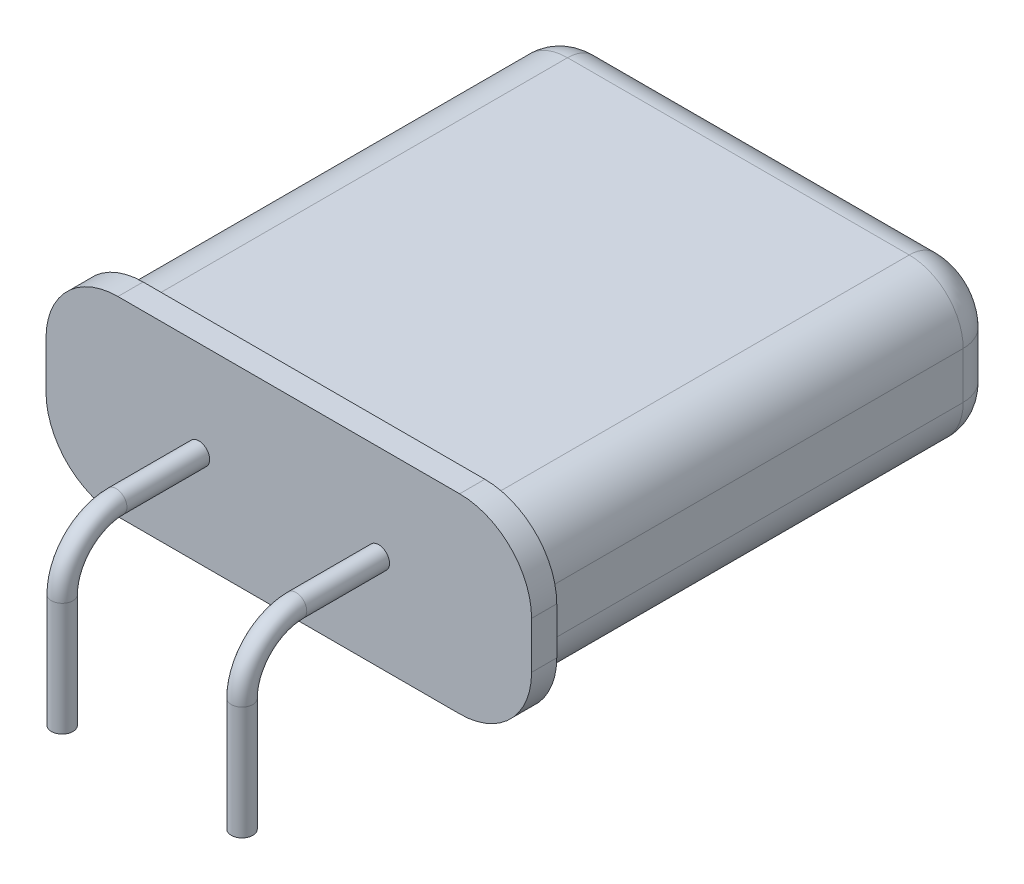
from build123d import *

# Parameters (mm, degrees)
EXTRUDE_1_DEPTH = 0.7
EXTRUDE_2_DEPTH = 12.8
FILLET_1_R      = 1
SKETCH_5_R      = 0.3


with BuildPart() as part:
    # Sketch 1 → Extrude 1 (new body)
    with BuildSketch(Plane.XY):
        with BuildLine():
            Line((2, 0), (11.5, 0))
            ThreePointArc((11.5, 0), (12.914213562, 0.585786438), (13.5, 2))
            Line((13.5, 2), (13.5, 3.3))
            ThreePointArc((13.5, 3.3), (12.914213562, 4.714213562), (11.5, 5.3))
            Line((11.5, 5.3), (2, 5.3))
            ThreePointArc((2, 5.3), (0.585786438, 4.714213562), (0, 3.3))
            Line((0, 3.3), (0, 2))
            ThreePointArc((0, 2), (0.585786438, 0.585786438), (2, 0))
        make_face()
    extrude(amount=-EXTRUDE_1_DEPTH)

    # Sketch 2 → Extrude 2 (add)
    with BuildSketch(Plane(origin=(0, 0, -0.7), x_dir=(-1, 0, 0), z_dir=(0, 0, -1))):
        with BuildLine():
            Line((-2, 4.8), (-11.5, 4.8))
            ThreePointArc((-11.5, 4.8), (-12.560660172, 4.360660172), (-13, 3.3))
            Line((-13, 3.3), (-13, 2))
            ThreePointArc((-13, 2), (-12.560660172, 0.939339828), (-11.5, 0.5))
            Line((-11.5, 0.5), (-2, 0.5))
            ThreePointArc((-2, 0.5), (-0.939339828, 0.939339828), (-0.5, 2))
            Line((-0.5, 2), (-0.5, 3.3))
            ThreePointArc((-0.5, 3.3), (-0.939339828, 4.360660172), (-2, 4.8))
        make_face()
    extrude(amount=EXTRUDE_2_DEPTH)

    # Fillet 1
    fillet_1_edges = [part.edges().sort_by_distance(p)[0] for p in [
        (0.939339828, 4.360660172, -13.5),
        (6.75, 4.8, -13.5),
        (12.560660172, 4.360660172, -13.5),
        (13, 2.65, -13.5),
        (12.560660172, 0.939339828, -13.5),
        (6.75, 0.5, -13.5),
        (0.939339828, 0.939339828, -13.5),
        (0.5, 2.65, -13.5),
    ]]
    fillet(fillet_1_edges, radius=FILLET_1_R)

    # Sweep 1: sweep along a path in Sketch 4
    with BuildLine(Plane(origin=(0, 0, 0), x_dir=(0, 0, -1), z_dir=(1, 0, 0))) as sweep_1_path:
        Line((0, 2.65), (-2.3, 2.65))
        ThreePointArc((-2.3, 2.65), (-3.360660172, 2.210660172), (-3.8, 1.15))
        Line((-3.8, 1.15), (-3.8, -2))
    # Sketch 5 → Sweep 1 (sweep)
    with BuildSketch(Plane.XY):
        with Locations((9.25, 2.65)):
            Circle(SKETCH_5_R)
        with Locations((4.25, 2.65)):
            Circle(SKETCH_5_R)
    sweep(path=sweep_1_path.line)


solid = part.part
